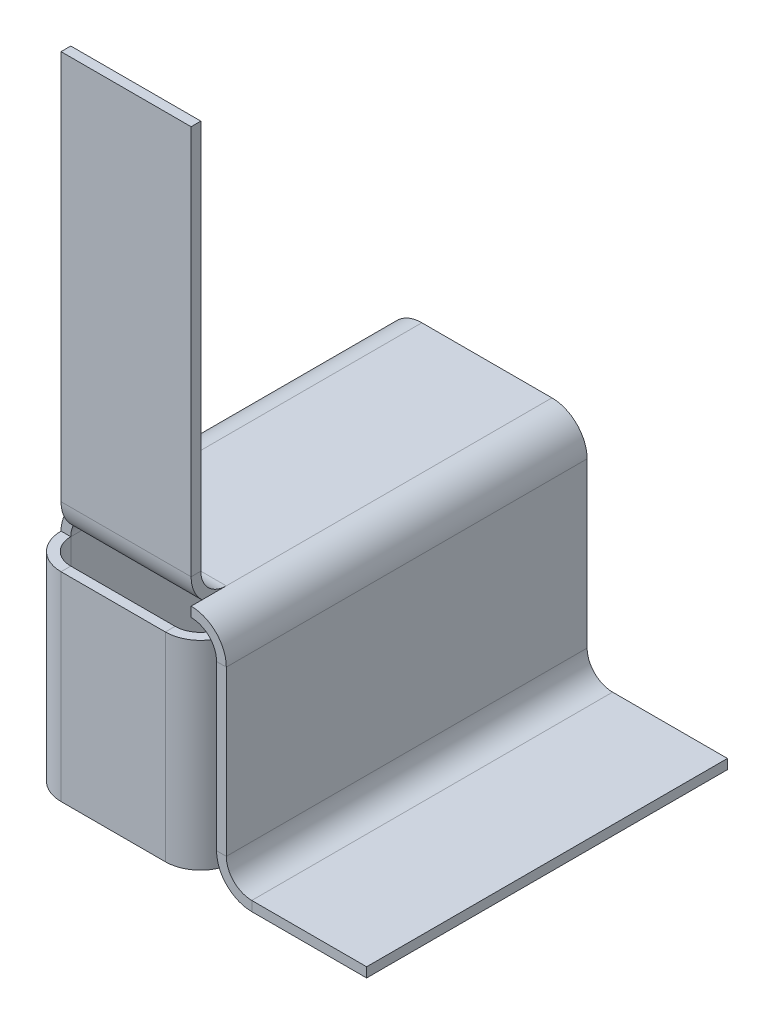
ISO-10303-21;
HEADER;
FILE_DESCRIPTION(('STEP AP214'),'2;1');
FILE_NAME('part.step','',(''),(''),'','','');
FILE_SCHEMA(('AUTOMOTIVE_DESIGN { 1 0 10303 214 1 1 1 1 }'));
ENDSEC;
DATA;
#1=APPLICATION_CONTEXT('core data for automotive mechanical design processes');
#2=APPLICATION_PROTOCOL_DEFINITION('international standard','automotive_design',2000,#1);
#3=PRODUCT_CONTEXT('',#1,'mechanical');
#4=PRODUCT('Part','Part','',(#3));
#5=PRODUCT_RELATED_PRODUCT_CATEGORY('part','',(#4));
#6=PRODUCT_DEFINITION_FORMATION('','',#4);
#7=PRODUCT_DEFINITION_CONTEXT('part definition',#1,'design');
#8=PRODUCT_DEFINITION('design','',#6,#7);
#9=PRODUCT_DEFINITION_SHAPE('','',#8);
#10=(LENGTH_UNIT() NAMED_UNIT(*) SI_UNIT(.MILLI.,.METRE.));
#11=(NAMED_UNIT(*) PLANE_ANGLE_UNIT() SI_UNIT($,.RADIAN.));
#12=(NAMED_UNIT(*) SI_UNIT($,.STERADIAN.) SOLID_ANGLE_UNIT());
#13=UNCERTAINTY_MEASURE_WITH_UNIT(LENGTH_MEASURE(1.E-05),#10,'distance_accuracy_value','');
#14=(GEOMETRIC_REPRESENTATION_CONTEXT(3) GLOBAL_UNCERTAINTY_ASSIGNED_CONTEXT((#13)) GLOBAL_UNIT_ASSIGNED_CONTEXT((#10,
#11,#12)) REPRESENTATION_CONTEXT('',''));
#15=CARTESIAN_POINT('',(0.,0.,0.));
#16=DIRECTION('',(0.,0.,1.));
#17=DIRECTION('',(1.,0.,0.));
#18=AXIS2_PLACEMENT_3D('',#15,#16,#17);
#19=CARTESIAN_POINT('',(-21.88912,28.,45.));
#20=DIRECTION('',(-1.,0.,0.));
#21=DIRECTION('',(0.,0.,1.));
#22=AXIS2_PLACEMENT_3D('',#19,#20,#21);
#23=PLANE('',#22);
#24=DIRECTION('',(0.,0.,-1.));
#25=VECTOR('',#24,1.);
#26=CARTESIAN_POINT('',(-21.88912,28.,45.));
#27=LINE('',#26,#25);
#28=CARTESIAN_POINT('',(-21.88912,28.,45.));
#29=VERTEX_POINT('',#28);
#30=CARTESIAN_POINT('',(-21.88912,28.,43.6413501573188));
#31=VERTEX_POINT('',#30);
#32=EDGE_CURVE('E552',#29,#31,#27,.T.);
#33=ORIENTED_EDGE('',*,*,#32,.T.);
#34=CARTESIAN_POINT('',(-21.88912,31.175,40.61088));
#35=DIRECTION('',(1.,0.,0.));
#36=DIRECTION('',(0.,0.,-1.));
#37=AXIS2_PLACEMENT_3D('',#34,#35,#36);
#38=CIRCLE('',#37,4.38912);
#39=CARTESIAN_POINT('',(-21.88912,26.78588,40.61088));
#40=VERTEX_POINT('',#39);
#41=EDGE_CURVE('E13',#31,#40,#38,.T.);
#42=ORIENTED_EDGE('',*,*,#41,.T.);
#43=DIRECTION('',(0.,0.,-1.));
#44=VECTOR('',#43,1.);
#45=CARTESIAN_POINT('',(-21.88912,26.78588,45.));
#46=LINE('',#45,#44);
#47=CARTESIAN_POINT('',(-21.88912,26.78588,45.));
#48=VERTEX_POINT('',#47);
#49=EDGE_CURVE('E536',#48,#40,#46,.T.);
#50=ORIENTED_EDGE('',*,*,#49,.F.);
#51=DIRECTION('',(0.,1.,0.));
#52=VECTOR('',#51,1.);
#53=CARTESIAN_POINT('',(-21.88912,26.78588,45.));
#54=LINE('',#53,#52);
#55=EDGE_CURVE('E580',#48,#29,#54,.T.);
#56=ORIENTED_EDGE('',*,*,#55,.T.);
#57=EDGE_LOOP('',(#33,#42,#50,#56));
#58=FACE_BOUND('',#57,.T.);
#59=ADVANCED_FACE('F98',(#58),#23,.T.);
#60=CARTESIAN_POINT('',(-42.5,28.,45.));
#61=DIRECTION('',(0.,1.,0.));
#62=DIRECTION('',(-1.,0.,0.));
#63=AXIS2_PLACEMENT_3D('',#60,#61,#62);
#64=PLANE('',#63);
#65=DIRECTION('',(0.,0.,-1.));
#66=VECTOR('',#65,1.);
#67=CARTESIAN_POINT('',(-38.11088,28.,45.));
#68=LINE('',#67,#66);
#69=CARTESIAN_POINT('',(-38.11088,28.,40.61088));
#70=VERTEX_POINT('',#69);
#71=CARTESIAN_POINT('',(-38.11088,28.,0.));
#72=VERTEX_POINT('',#71);
#73=EDGE_CURVE('E549',#70,#72,#68,.T.);
#74=ORIENTED_EDGE('',*,*,#73,.F.);
#75=DIRECTION('',(1.,0.,0.));
#76=VECTOR('',#75,1.);
#77=CARTESIAN_POINT('',(-21.88912,28.,40.61088));
#78=LINE('',#77,#76);
#79=CARTESIAN_POINT('',(-21.88912,28.,40.61088));
#80=VERTEX_POINT('',#79);
#81=EDGE_CURVE('E346',#80,#70,#78,.F.);
#82=ORIENTED_EDGE('',*,*,#81,.F.);
#83=CARTESIAN_POINT('',(-21.88912,28.,0.));
#84=VERTEX_POINT('',#83);
#85=EDGE_CURVE('E551',#80,#84,#27,.T.);
#86=ORIENTED_EDGE('',*,*,#85,.T.);
#87=DIRECTION('',(1.,0.,0.));
#88=VECTOR('',#87,1.);
#89=CARTESIAN_POINT('',(-42.5,28.,0.));
#90=LINE('',#89,#88);
#91=EDGE_CURVE('E498',#72,#84,#90,.T.);
#92=ORIENTED_EDGE('',*,*,#91,.F.);
#93=EDGE_LOOP('',(#74,#82,#86,#92));
#94=FACE_BOUND('',#93,.T.);
#95=ADVANCED_FACE('F603',(#94),#64,.T.);
#96=CARTESIAN_POINT('',(-42.5,26.78588,45.));
#97=DIRECTION('',(0.,1.,0.));
#98=DIRECTION('',(-1.,0.,0.));
#99=AXIS2_PLACEMENT_3D('',#96,#97,#98);
#100=PLANE('',#99);
#101=DIRECTION('',(1.,0.,0.));
#102=VECTOR('',#101,1.);
#103=CARTESIAN_POINT('',(-21.88912,26.78588,40.61088));
#104=LINE('',#103,#102);
#105=CARTESIAN_POINT('',(-38.11088,26.78588,40.61088));
#106=VERTEX_POINT('',#105);
#107=EDGE_CURVE('E335',#40,#106,#104,.F.);
#108=ORIENTED_EDGE('',*,*,#107,.T.);
#109=DIRECTION('',(0.,0.,-1.));
#110=VECTOR('',#109,1.);
#111=CARTESIAN_POINT('',(-38.11088,26.78588,45.));
#112=LINE('',#111,#110);
#113=CARTESIAN_POINT('',(-38.11088,26.78588,0.));
#114=VERTEX_POINT('',#113);
#115=EDGE_CURVE('E539',#106,#114,#112,.T.);
#116=ORIENTED_EDGE('',*,*,#115,.T.);
#117=DIRECTION('',(1.,0.,0.));
#118=VECTOR('',#117,1.);
#119=CARTESIAN_POINT('',(-42.5,26.78588,0.));
#120=LINE('',#119,#118);
#121=CARTESIAN_POINT('',(-21.88912,26.78588,0.));
#122=VERTEX_POINT('',#121);
#123=EDGE_CURVE('E516',#114,#122,#120,.T.);
#124=ORIENTED_EDGE('',*,*,#123,.T.);
#125=EDGE_CURVE('E535',#40,#122,#46,.T.);
#126=ORIENTED_EDGE('',*,*,#125,.F.);
#127=EDGE_LOOP('',(#108,#116,#124,#126));
#128=FACE_BOUND('',#127,.T.);
#129=ADVANCED_FACE('F717',(#128),#100,.F.);
#130=CARTESIAN_POINT('',(-20.71412,-1.21412,45.0000000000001));
#131=DIRECTION('',(0.,1.,0.));
#132=DIRECTION('',(-1.,0.,0.));
#133=AXIS2_PLACEMENT_3D('',#130,#131,#132);
#134=PLANE('',#133);
#135=DIRECTION('',(0.,0.,1.));
#136=VECTOR('',#135,1.);
#137=CARTESIAN_POINT('',(-25.10324,-1.21412,43.7858800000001));
#138=LINE('',#137,#136);
#139=CARTESIAN_POINT('',(-25.10324,-1.21412,43.7858800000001));
#140=VERTEX_POINT('',#139);
#141=CARTESIAN_POINT('',(-25.10324,-1.21412,45.0000000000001));
#142=VERTEX_POINT('',#141);
#143=EDGE_CURVE('E393',#140,#142,#138,.T.);
#144=ORIENTED_EDGE('',*,*,#143,.T.);
#145=DIRECTION('',(1.,0.,0.));
#146=VECTOR('',#145,1.);
#147=CARTESIAN_POINT('',(-1.55871364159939E-13,-1.21411999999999,45.0000000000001));
#148=LINE('',#147,#146);
#149=CARTESIAN_POINT('',(-38.11088,-1.21412,45.));
#150=VERTEX_POINT('',#149);
#151=EDGE_CURVE('E413',#150,#142,#148,.T.);
#152=ORIENTED_EDGE('',*,*,#151,.F.);
#153=DIRECTION('',(0.,0.,-1.));
#154=VECTOR('',#153,1.);
#155=CARTESIAN_POINT('',(-38.11088,-1.21412,43.78588));
#156=LINE('',#155,#154);
#157=CARTESIAN_POINT('',(-38.11088,-1.21412,43.78588));
#158=VERTEX_POINT('',#157);
#159=EDGE_CURVE('E423',#158,#150,#156,.F.);
#160=ORIENTED_EDGE('',*,*,#159,.F.);
#161=DIRECTION('',(-1.,0.,0.));
#162=VECTOR('',#161,1.);
#163=CARTESIAN_POINT('',(-20.71412,-1.21412,43.7858800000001));
#164=LINE('',#163,#162);
#165=EDGE_CURVE('E417',#158,#140,#164,.F.);
#166=ORIENTED_EDGE('',*,*,#165,.T.);
#167=EDGE_LOOP('',(#144,#152,#160,#166));
#168=FACE_BOUND('',#167,.T.);
#169=ADVANCED_FACE('F670',(#168),#134,.F.);
#170=CARTESIAN_POINT('',(-41.28588,23.61088,45.));
#171=DIRECTION('',(0.,-1.,0.));
#172=DIRECTION('',(0.,0.,-1.));
#173=AXIS2_PLACEMENT_3D('',#170,#171,#172);
#174=PLANE('',#173);
#175=DIRECTION('',(0.,0.,1.));
#176=VECTOR('',#175,1.);
#177=CARTESIAN_POINT('',(-25.10324,23.61088,43.7858800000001));
#178=LINE('',#177,#176);
#179=CARTESIAN_POINT('',(-25.10324,23.61088,43.7858800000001));
#180=VERTEX_POINT('',#179);
#181=CARTESIAN_POINT('',(-25.10324,23.61088,45.0000000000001));
#182=VERTEX_POINT('',#181);
#183=EDGE_CURVE('E404',#180,#182,#178,.T.);
#184=ORIENTED_EDGE('',*,*,#183,.F.);
#185=DIRECTION('',(1.,0.,0.));
#186=VECTOR('',#185,1.);
#187=CARTESIAN_POINT('',(-41.28588,23.61088,43.78588));
#188=LINE('',#187,#186);
#189=CARTESIAN_POINT('',(-38.11088,23.61088,43.78588));
#190=VERTEX_POINT('',#189);
#191=EDGE_CURVE('E415',#180,#190,#188,.F.);
#192=ORIENTED_EDGE('',*,*,#191,.T.);
#193=DIRECTION('',(0.,0.,-1.));
#194=VECTOR('',#193,1.);
#195=CARTESIAN_POINT('',(-38.11088,23.61088,45.));
#196=LINE('',#195,#194);
#197=CARTESIAN_POINT('',(-38.11088,23.61088,45.));
#198=VERTEX_POINT('',#197);
#199=EDGE_CURVE('E407',#190,#198,#196,.F.);
#200=ORIENTED_EDGE('',*,*,#199,.T.);
#201=DIRECTION('',(-1.,0.,0.));
#202=VECTOR('',#201,1.);
#203=CARTESIAN_POINT('',(-1.56024936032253E-13,23.61088,45.0000000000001));
#204=LINE('',#203,#202);
#205=EDGE_CURVE('E410',#182,#198,#204,.T.);
#206=ORIENTED_EDGE('',*,*,#205,.F.);
#207=EDGE_LOOP('',(#184,#192,#200,#206));
#208=FACE_BOUND('',#207,.T.);
#209=ADVANCED_FACE('F907',(#208),#174,.F.);
#210=CARTESIAN_POINT('',(-1.56024936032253E-13,0.,45.0000000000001));
#211=DIRECTION('',(0.,0.,-1.));
#212=DIRECTION('',(-1.,0.,0.));
#213=AXIS2_PLACEMENT_3D('',#210,#211,#212);
#214=PLANE('',#213);
#215=DIRECTION('',(0.,-1.,0.));
#216=VECTOR('',#215,1.);
#217=CARTESIAN_POINT('',(-25.10324,-1.21412,45.0000000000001));
#218=LINE('',#217,#216);
#219=EDGE_CURVE('E387',#142,#182,#218,.F.);
#220=ORIENTED_EDGE('',*,*,#219,.T.);
#221=ORIENTED_EDGE('',*,*,#205,.T.);
#222=DIRECTION('',(0.,-1.,0.));
#223=VECTOR('',#222,1.);
#224=CARTESIAN_POINT('',(-38.11088,23.61088,45.));
#225=LINE('',#224,#223);
#226=EDGE_CURVE('E420',#150,#198,#225,.F.);
#227=ORIENTED_EDGE('',*,*,#226,.F.);
#228=ORIENTED_EDGE('',*,*,#151,.T.);
#229=EDGE_LOOP('',(#220,#221,#227,#228));
#230=FACE_BOUND('',#229,.T.);
#231=ADVANCED_FACE('F668',(#230),#214,.F.);
#232=CARTESIAN_POINT('',(-1.51785858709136E-13,0.,43.7858800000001));
#233=DIRECTION('',(0.,0.,-1.));
#234=DIRECTION('',(-1.,0.,0.));
#235=AXIS2_PLACEMENT_3D('',#232,#233,#234);
#236=PLANE('',#235);
#237=ORIENTED_EDGE('',*,*,#191,.F.);
#238=DIRECTION('',(0.,-1.,0.));
#239=VECTOR('',#238,1.);
#240=CARTESIAN_POINT('',(-25.10324,-1.21412,43.7858800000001));
#241=LINE('',#240,#239);
#242=EDGE_CURVE('E399',#140,#180,#241,.F.);
#243=ORIENTED_EDGE('',*,*,#242,.F.);
#244=ORIENTED_EDGE('',*,*,#165,.F.);
#245=DIRECTION('',(0.,-1.,0.));
#246=VECTOR('',#245,1.);
#247=CARTESIAN_POINT('',(-38.11088,23.61088,43.78588));
#248=LINE('',#247,#246);
#249=EDGE_CURVE('E426',#190,#158,#248,.T.);
#250=ORIENTED_EDGE('',*,*,#249,.F.);
#251=EDGE_LOOP('',(#237,#243,#244,#250));
#252=FACE_BOUND('',#251,.T.);
#253=ADVANCED_FACE('F925',(#252),#236,.T.);
#254=CARTESIAN_POINT('',(-38.11088,23.61088,45.));
#255=DIRECTION('',(0.,0.,-1.));
#256=DIRECTION('',(-1.,0.,0.));
#257=AXIS2_PLACEMENT_3D('',#254,#255,#256);
#258=CYLINDRICAL_SURFACE('',#257,4.38912);
#259=DIRECTION('',(0.,0.,-1.));
#260=VECTOR('',#259,1.);
#261=CARTESIAN_POINT('',(-42.5,23.61088,45.));
#262=LINE('',#261,#260);
#263=CARTESIAN_POINT('',(-42.5,23.61088,40.61088));
#264=VERTEX_POINT('',#263);
#265=CARTESIAN_POINT('',(-42.5,23.61088,0.));
#266=VERTEX_POINT('',#265);
#267=EDGE_CURVE('E547',#264,#266,#262,.T.);
#268=ORIENTED_EDGE('',*,*,#267,.F.);
#269=CARTESIAN_POINT('',(-38.11088,23.61088,40.61088));
#270=DIRECTION('',(0.,0.,1.));
#271=DIRECTION('',(1.,0.,0.));
#272=AXIS2_PLACEMENT_3D('',#269,#270,#271);
#273=CIRCLE('',#272,4.38912);
#274=EDGE_CURVE('E102',#264,#70,#273,.F.);
#275=ORIENTED_EDGE('',*,*,#274,.T.);
#276=ORIENTED_EDGE('',*,*,#73,.T.);
#277=CARTESIAN_POINT('',(-38.11088,23.61088,0.));
#278=DIRECTION('',(0.,0.,1.));
#279=DIRECTION('',(1.,0.,0.));
#280=AXIS2_PLACEMENT_3D('',#277,#278,#279);
#281=CIRCLE('',#280,4.38912);
#282=EDGE_CURVE('E501',#266,#72,#281,.F.);
#283=ORIENTED_EDGE('',*,*,#282,.F.);
#284=EDGE_LOOP('',(#268,#275,#276,#283));
#285=FACE_BOUND('',#284,.T.);
#286=ADVANCED_FACE('F599',(#285),#258,.T.);
#287=CARTESIAN_POINT('',(-38.11088,23.61088,40.61088));
#288=DIRECTION('',(0.,0.,1.));
#289=DIRECTION('',(1.,0.,0.));
#290=AXIS2_PLACEMENT_3D('',#287,#288,#289);
#291=PLANE('',#290);
#292=DIRECTION('',(0.,-1.,0.));
#293=VECTOR('',#292,1.);
#294=CARTESIAN_POINT('',(-38.11088,28.,40.61088));
#295=LINE('',#294,#293);
#296=EDGE_CURVE('E340',#70,#106,#295,.T.);
#297=ORIENTED_EDGE('',*,*,#296,.F.);
#298=ORIENTED_EDGE('',*,*,#274,.F.);
#299=DIRECTION('',(-1.,0.,0.));
#300=VECTOR('',#299,1.);
#301=CARTESIAN_POINT('',(-41.28588,23.61088,40.61088));
#302=LINE('',#301,#300);
#303=CARTESIAN_POINT('',(-41.28588,23.61088,40.61088));
#304=VERTEX_POINT('',#303);
#305=EDGE_CURVE('E447',#304,#264,#302,.T.);
#306=ORIENTED_EDGE('',*,*,#305,.F.);
#307=CARTESIAN_POINT('',(-38.11088,23.61088,40.61088));
#308=DIRECTION('',(0.,0.,1.));
#309=DIRECTION('',(1.,0.,0.));
#310=AXIS2_PLACEMENT_3D('',#307,#308,#309);
#311=CIRCLE('',#310,3.175);
#312=EDGE_CURVE('E589',#304,#106,#311,.F.);
#313=ORIENTED_EDGE('',*,*,#312,.T.);
#314=EDGE_LOOP('',(#297,#298,#306,#313));
#315=FACE_BOUND('',#314,.T.);
#316=ADVANCED_FACE('F100',(#315),#291,.T.);
#317=CARTESIAN_POINT('',(-42.5,28.,45.));
#318=DIRECTION('',(-1.,0.,0.));
#319=DIRECTION('',(0.,-1.,0.));
#320=AXIS2_PLACEMENT_3D('',#317,#318,#319);
#321=PLANE('',#320);
#322=DIRECTION('',(0.,0.,-1.));
#323=VECTOR('',#322,1.);
#324=CARTESIAN_POINT('',(-42.5,-1.21412,45.));
#325=LINE('',#324,#323);
#326=CARTESIAN_POINT('',(-42.5,-1.21412,40.61088));
#327=VERTEX_POINT('',#326);
#328=CARTESIAN_POINT('',(-42.5,-1.21412,0.));
#329=VERTEX_POINT('',#328);
#330=EDGE_CURVE('E545',#327,#329,#325,.T.);
#331=ORIENTED_EDGE('',*,*,#330,.F.);
#332=DIRECTION('',(0.,-1.,0.));
#333=VECTOR('',#332,1.);
#334=CARTESIAN_POINT('',(-42.5,-1.21412,40.61088));
#335=LINE('',#334,#333);
#336=EDGE_CURVE('E430',#327,#264,#335,.F.);
#337=ORIENTED_EDGE('',*,*,#336,.T.);
#338=ORIENTED_EDGE('',*,*,#267,.T.);
#339=DIRECTION('',(0.,1.,0.));
#340=VECTOR('',#339,1.);
#341=CARTESIAN_POINT('',(-42.5,28.,0.));
#342=LINE('',#341,#340);
#343=EDGE_CURVE('E504',#329,#266,#342,.T.);
#344=ORIENTED_EDGE('',*,*,#343,.F.);
#345=EDGE_LOOP('',(#331,#337,#338,#344));
#346=FACE_BOUND('',#345,.T.);
#347=ADVANCED_FACE('F656',(#346),#321,.T.);
#348=CARTESIAN_POINT('',(-41.28588,-1.21412,45.));
#349=DIRECTION('',(0.,-1.,0.));
#350=DIRECTION('',(1.,0.,0.));
#351=AXIS2_PLACEMENT_3D('',#348,#349,#350);
#352=PLANE('',#351);
#353=DIRECTION('',(0.,0.,-1.));
#354=VECTOR('',#353,1.);
#355=CARTESIAN_POINT('',(-41.28588,-1.21412,45.));
#356=LINE('',#355,#354);
#357=CARTESIAN_POINT('',(-41.28588,-1.21412,40.61088));
#358=VERTEX_POINT('',#357);
#359=CARTESIAN_POINT('',(-41.28588,-1.21412,0.));
#360=VERTEX_POINT('',#359);
#361=EDGE_CURVE('E543',#358,#360,#356,.T.);
#362=ORIENTED_EDGE('',*,*,#361,.F.);
#363=DIRECTION('',(-1.,0.,0.));
#364=VECTOR('',#363,1.);
#365=CARTESIAN_POINT('',(-41.28588,-1.21412,40.61088));
#366=LINE('',#365,#364);
#367=EDGE_CURVE('E437',#358,#327,#366,.T.);
#368=ORIENTED_EDGE('',*,*,#367,.T.);
#369=ORIENTED_EDGE('',*,*,#330,.T.);
#370=DIRECTION('',(-1.,0.,0.));
#371=VECTOR('',#370,1.);
#372=CARTESIAN_POINT('',(-41.28588,-1.21412,0.));
#373=LINE('',#372,#371);
#374=EDGE_CURVE('E507',#360,#329,#373,.T.);
#375=ORIENTED_EDGE('',*,*,#374,.F.);
#376=EDGE_LOOP('',(#362,#368,#369,#375));
#377=FACE_BOUND('',#376,.T.);
#378=ADVANCED_FACE('F653',(#377),#352,.T.);
#379=CARTESIAN_POINT('',(-41.28588,28.,45.));
#380=DIRECTION('',(-1.,0.,0.));
#381=DIRECTION('',(0.,-1.,0.));
#382=AXIS2_PLACEMENT_3D('',#379,#380,#381);
#383=PLANE('',#382);
#384=DIRECTION('',(0.,-1.,0.));
#385=VECTOR('',#384,1.);
#386=CARTESIAN_POINT('',(-41.28588,-1.21412,40.61088));
#387=LINE('',#386,#385);
#388=EDGE_CURVE('E443',#358,#304,#387,.F.);
#389=ORIENTED_EDGE('',*,*,#388,.F.);
#390=ORIENTED_EDGE('',*,*,#361,.T.);
#391=DIRECTION('',(0.,1.,0.));
#392=VECTOR('',#391,1.);
#393=CARTESIAN_POINT('',(-41.28588,28.,0.));
#394=LINE('',#393,#392);
#395=CARTESIAN_POINT('',(-41.28588,23.61088,0.));
#396=VERTEX_POINT('',#395);
#397=EDGE_CURVE('E510',#360,#396,#394,.T.);
#398=ORIENTED_EDGE('',*,*,#397,.T.);
#399=DIRECTION('',(0.,0.,-1.));
#400=VECTOR('',#399,1.);
#401=CARTESIAN_POINT('',(-41.28588,23.61088,45.));
#402=LINE('',#401,#400);
#403=EDGE_CURVE('E541',#304,#396,#402,.T.);
#404=ORIENTED_EDGE('',*,*,#403,.F.);
#405=EDGE_LOOP('',(#389,#390,#398,#404));
#406=FACE_BOUND('',#405,.T.);
#407=ADVANCED_FACE('F650',(#406),#383,.F.);
#408=CARTESIAN_POINT('',(-42.5,23.61088,0.));
#409=DIRECTION('',(0.,0.,-1.));
#410=DIRECTION('',(-1.,0.,0.));
#411=AXIS2_PLACEMENT_3D('',#408,#409,#410);
#412=PLANE('',#411);
#413=DIRECTION('',(1.,0.,0.));
#414=VECTOR('',#413,1.);
#415=CARTESIAN_POINT('',(-42.5,23.61088,0.));
#416=LINE('',#415,#414);
#417=EDGE_CURVE('E587',#266,#396,#416,.T.);
#418=ORIENTED_EDGE('',*,*,#417,.F.);
#419=ORIENTED_EDGE('',*,*,#282,.T.);
#420=DIRECTION('',(0.,1.,0.));
#421=VECTOR('',#420,1.);
#422=CARTESIAN_POINT('',(-38.11088,26.78588,0.));
#423=LINE('',#422,#421);
#424=EDGE_CURVE('E584',#114,#72,#423,.T.);
#425=ORIENTED_EDGE('',*,*,#424,.F.);
#426=CARTESIAN_POINT('',(-38.11088,23.61088,0.));
#427=DIRECTION('',(0.,0.,1.));
#428=DIRECTION('',(1.,0.,0.));
#429=AXIS2_PLACEMENT_3D('',#426,#427,#428);
#430=CIRCLE('',#429,3.175);
#431=EDGE_CURVE('E513',#396,#114,#430,.F.);
#432=ORIENTED_EDGE('',*,*,#431,.F.);
#433=EDGE_LOOP('',(#418,#419,#425,#432));
#434=FACE_BOUND('',#433,.T.);
#435=ADVANCED_FACE('F639',(#434),#412,.T.);
#436=CARTESIAN_POINT('',(-38.11088,26.78588,0.));
#437=DIRECTION('',(0.,0.,-1.));
#438=DIRECTION('',(-1.,0.,0.));
#439=AXIS2_PLACEMENT_3D('',#436,#437,#438);
#440=PLANE('',#439);
#441=ORIENTED_EDGE('',*,*,#343,.T.);
#442=ORIENTED_EDGE('',*,*,#417,.T.);
#443=ORIENTED_EDGE('',*,*,#397,.F.);
#444=ORIENTED_EDGE('',*,*,#374,.T.);
#445=EDGE_LOOP('',(#441,#442,#443,#444));
#446=FACE_BOUND('',#445,.T.);
#447=ADVANCED_FACE('F647',(#446),#440,.T.);
#448=CARTESIAN_POINT('',(-17.5,23.61088,45.));
#449=DIRECTION('',(0.,0.,1.));
#450=DIRECTION('',(1.,0.,0.));
#451=AXIS2_PLACEMENT_3D('',#448,#449,#450);
#452=PLANE('',#451);
#453=DIRECTION('',(-1.,0.,0.));
#454=VECTOR('',#453,1.);
#455=CARTESIAN_POINT('',(-17.5,23.61088,45.));
#456=LINE('',#455,#454);
#457=CARTESIAN_POINT('',(-17.5,23.61088,45.));
#458=VERTEX_POINT('',#457);
#459=CARTESIAN_POINT('',(-18.71412,23.61088,45.));
#460=VERTEX_POINT('',#459);
#461=EDGE_CURVE('E582',#458,#460,#456,.T.);
#462=ORIENTED_EDGE('',*,*,#461,.F.);
#463=CARTESIAN_POINT('',(-21.88912,23.61088,45.));
#464=DIRECTION('',(0.,0.,1.));
#465=DIRECTION('',(1.,0.,0.));
#466=AXIS2_PLACEMENT_3D('',#463,#464,#465);
#467=CIRCLE('',#466,4.38912);
#468=EDGE_CURVE('E468',#29,#458,#467,.F.);
#469=ORIENTED_EDGE('',*,*,#468,.F.);
#470=ORIENTED_EDGE('',*,*,#55,.F.);
#471=CARTESIAN_POINT('',(-21.88912,23.61088,45.));
#472=DIRECTION('',(0.,0.,1.));
#473=DIRECTION('',(1.,0.,0.));
#474=AXIS2_PLACEMENT_3D('',#471,#472,#473);
#475=CIRCLE('',#474,3.175);
#476=EDGE_CURVE('E471',#48,#460,#475,.F.);
#477=ORIENTED_EDGE('',*,*,#476,.T.);
#478=EDGE_LOOP('',(#462,#469,#470,#477));
#479=FACE_BOUND('',#478,.T.);
#480=ADVANCED_FACE('F1203',(#479),#452,.T.);
#481=CARTESIAN_POINT('',(-21.88912,26.78588,45.));
#482=DIRECTION('',(0.,0.,1.));
#483=DIRECTION('',(1.,0.,0.));
#484=AXIS2_PLACEMENT_3D('',#481,#482,#483);
#485=PLANE('',#484);
#486=DIRECTION('',(0.,-1.,0.));
#487=VECTOR('',#486,1.);
#488=CARTESIAN_POINT('',(-17.5,28.,45.));
#489=LINE('',#488,#487);
#490=CARTESIAN_POINT('',(-17.5,3.175,45.));
#491=VERTEX_POINT('',#490);
#492=EDGE_CURVE('E465',#458,#491,#489,.T.);
#493=ORIENTED_EDGE('',*,*,#492,.F.);
#494=ORIENTED_EDGE('',*,*,#461,.T.);
#495=DIRECTION('',(0.,1.,0.));
#496=VECTOR('',#495,1.);
#497=CARTESIAN_POINT('',(-18.71412,28.,45.));
#498=LINE('',#497,#496);
#499=CARTESIAN_POINT('',(-18.71412,3.175,45.));
#500=VERTEX_POINT('',#499);
#501=EDGE_CURVE('E474',#460,#500,#498,.F.);
#502=ORIENTED_EDGE('',*,*,#501,.T.);
#503=DIRECTION('',(1.,0.,0.));
#504=VECTOR('',#503,1.);
#505=CARTESIAN_POINT('',(-18.71412,3.175,45.));
#506=LINE('',#505,#504);
#507=EDGE_CURVE('E571',#500,#491,#506,.T.);
#508=ORIENTED_EDGE('',*,*,#507,.T.);
#509=EDGE_LOOP('',(#493,#494,#502,#508));
#510=FACE_BOUND('',#509,.T.);
#511=ADVANCED_FACE('F1194',(#510),#485,.T.);
#512=CARTESIAN_POINT('',(-21.88912,28.,0.));
#513=DIRECTION('',(0.,0.,-1.));
#514=DIRECTION('',(-1.,0.,0.));
#515=AXIS2_PLACEMENT_3D('',#512,#513,#514);
#516=PLANE('',#515);
#517=DIRECTION('',(0.,-1.,0.));
#518=VECTOR('',#517,1.);
#519=CARTESIAN_POINT('',(-21.88912,28.,0.));
#520=LINE('',#519,#518);
#521=EDGE_CURVE('E577',#84,#122,#520,.T.);
#522=ORIENTED_EDGE('',*,*,#521,.F.);
#523=CARTESIAN_POINT('',(-21.88912,23.61088,0.));
#524=DIRECTION('',(0.,0.,1.));
#525=DIRECTION('',(1.,0.,0.));
#526=AXIS2_PLACEMENT_3D('',#523,#524,#525);
#527=CIRCLE('',#526,4.38912);
#528=CARTESIAN_POINT('',(-17.5,23.61088,0.));
#529=VERTEX_POINT('',#528);
#530=EDGE_CURVE('E495',#84,#529,#527,.F.);
#531=ORIENTED_EDGE('',*,*,#530,.T.);
#532=DIRECTION('',(1.,0.,0.));
#533=VECTOR('',#532,1.);
#534=CARTESIAN_POINT('',(-18.71412,23.61088,0.));
#535=LINE('',#534,#533);
#536=CARTESIAN_POINT('',(-18.71412,23.61088,0.));
#537=VERTEX_POINT('',#536);
#538=EDGE_CURVE('E575',#537,#529,#535,.T.);
#539=ORIENTED_EDGE('',*,*,#538,.F.);
#540=CARTESIAN_POINT('',(-21.88912,23.61088,0.));
#541=DIRECTION('',(0.,0.,1.));
#542=DIRECTION('',(1.,0.,0.));
#543=AXIS2_PLACEMENT_3D('',#540,#541,#542);
#544=CIRCLE('',#543,3.175);
#545=EDGE_CURVE('E519',#122,#537,#544,.F.);
#546=ORIENTED_EDGE('',*,*,#545,.F.);
#547=EDGE_LOOP('',(#522,#531,#539,#546));
#548=FACE_BOUND('',#547,.T.);
#549=ADVANCED_FACE('F628',(#548),#516,.T.);
#550=CARTESIAN_POINT('',(-18.71412,23.61088,0.));
#551=DIRECTION('',(0.,0.,-1.));
#552=DIRECTION('',(-1.,0.,0.));
#553=AXIS2_PLACEMENT_3D('',#550,#551,#552);
#554=PLANE('',#553);
#555=ORIENTED_EDGE('',*,*,#91,.T.);
#556=ORIENTED_EDGE('',*,*,#521,.T.);
#557=ORIENTED_EDGE('',*,*,#123,.F.);
#558=ORIENTED_EDGE('',*,*,#424,.T.);
#559=EDGE_LOOP('',(#555,#556,#557,#558));
#560=FACE_BOUND('',#559,.T.);
#561=ADVANCED_FACE('F634',(#560),#554,.T.);
#562=CARTESIAN_POINT('',(-14.325,0.,45.));
#563=DIRECTION('',(0.,0.,1.));
#564=DIRECTION('',(1.,0.,0.));
#565=AXIS2_PLACEMENT_3D('',#562,#563,#564);
#566=PLANE('',#565);
#567=DIRECTION('',(0.,-1.,0.));
#568=VECTOR('',#567,1.);
#569=CARTESIAN_POINT('',(-14.325,0.,45.));
#570=LINE('',#569,#568);
#571=CARTESIAN_POINT('',(-14.325,0.,45.));
#572=VERTEX_POINT('',#571);
#573=CARTESIAN_POINT('',(-14.325,-1.21412,45.));
#574=VERTEX_POINT('',#573);
#575=EDGE_CURVE('E573',#572,#574,#570,.T.);
#576=ORIENTED_EDGE('',*,*,#575,.F.);
#577=CARTESIAN_POINT('',(-14.325,3.175,45.));
#578=DIRECTION('',(0.,0.,-1.));
#579=DIRECTION('',(-1.,0.,0.));
#580=AXIS2_PLACEMENT_3D('',#577,#578,#579);
#581=CIRCLE('',#580,3.175);
#582=EDGE_CURVE('E462',#491,#572,#581,.F.);
#583=ORIENTED_EDGE('',*,*,#582,.F.);
#584=ORIENTED_EDGE('',*,*,#507,.F.);
#585=CARTESIAN_POINT('',(-14.325,3.175,45.));
#586=DIRECTION('',(0.,0.,1.));
#587=DIRECTION('',(1.,0.,0.));
#588=AXIS2_PLACEMENT_3D('',#585,#586,#587);
#589=CIRCLE('',#588,4.38912);
#590=EDGE_CURVE('E477',#500,#574,#589,.T.);
#591=ORIENTED_EDGE('',*,*,#590,.T.);
#592=EDGE_LOOP('',(#576,#583,#584,#591));
#593=FACE_BOUND('',#592,.T.);
#594=ADVANCED_FACE('F1165',(#593),#566,.T.);
#595=CARTESIAN_POINT('',(-18.71412,3.175,45.));
#596=DIRECTION('',(0.,0.,1.));
#597=DIRECTION('',(1.,0.,0.));
#598=AXIS2_PLACEMENT_3D('',#595,#596,#597);
#599=PLANE('',#598);
#600=DIRECTION('',(1.,0.,0.));
#601=VECTOR('',#600,1.);
#602=CARTESIAN_POINT('',(-17.5,0.,45.));
#603=LINE('',#602,#601);
#604=CARTESIAN_POINT('',(0.,0.,45.));
#605=VERTEX_POINT('',#604);
#606=EDGE_CURVE('E459',#572,#605,#603,.T.);
#607=ORIENTED_EDGE('',*,*,#606,.F.);
#608=ORIENTED_EDGE('',*,*,#575,.T.);
#609=DIRECTION('',(1.,0.,0.));
#610=VECTOR('',#609,1.);
#611=CARTESIAN_POINT('',(-17.5,-1.21412,45.));
#612=LINE('',#611,#610);
#613=CARTESIAN_POINT('',(0.,-1.21412,45.));
#614=VERTEX_POINT('',#613);
#615=EDGE_CURVE('E453',#574,#614,#612,.T.);
#616=ORIENTED_EDGE('',*,*,#615,.T.);
#617=DIRECTION('',(0.,-1.,0.));
#618=VECTOR('',#617,1.);
#619=CARTESIAN_POINT('',(0.,0.,45.));
#620=LINE('',#619,#618);
#621=EDGE_CURVE('E455',#605,#614,#620,.T.);
#622=ORIENTED_EDGE('',*,*,#621,.F.);
#623=EDGE_LOOP('',(#607,#608,#616,#622));
#624=FACE_BOUND('',#623,.T.);
#625=ADVANCED_FACE('F1155',(#624),#599,.T.);
#626=CARTESIAN_POINT('',(-17.5,3.175,0.));
#627=DIRECTION('',(0.,0.,-1.));
#628=DIRECTION('',(-1.,0.,0.));
#629=AXIS2_PLACEMENT_3D('',#626,#627,#628);
#630=PLANE('',#629);
#631=DIRECTION('',(-1.,0.,0.));
#632=VECTOR('',#631,1.);
#633=CARTESIAN_POINT('',(-17.5,3.175,0.));
#634=LINE('',#633,#632);
#635=CARTESIAN_POINT('',(-17.5,3.175,0.));
#636=VERTEX_POINT('',#635);
#637=CARTESIAN_POINT('',(-18.71412,3.175,0.));
#638=VERTEX_POINT('',#637);
#639=EDGE_CURVE('E569',#636,#638,#634,.T.);
#640=ORIENTED_EDGE('',*,*,#639,.F.);
#641=CARTESIAN_POINT('',(-14.325,3.175,0.));
#642=DIRECTION('',(0.,0.,-1.));
#643=DIRECTION('',(-1.,0.,0.));
#644=AXIS2_PLACEMENT_3D('',#641,#642,#643);
#645=CIRCLE('',#644,3.175);
#646=CARTESIAN_POINT('',(-14.325,0.,0.));
#647=VERTEX_POINT('',#646);
#648=EDGE_CURVE('E489',#636,#647,#645,.F.);
#649=ORIENTED_EDGE('',*,*,#648,.T.);
#650=DIRECTION('',(0.,1.,0.));
#651=VECTOR('',#650,1.);
#652=CARTESIAN_POINT('',(-14.325,-1.21412,0.));
#653=LINE('',#652,#651);
#654=CARTESIAN_POINT('',(-14.325,-1.21412,0.));
#655=VERTEX_POINT('',#654);
#656=EDGE_CURVE('E567',#655,#647,#653,.T.);
#657=ORIENTED_EDGE('',*,*,#656,.F.);
#658=CARTESIAN_POINT('',(-14.325,3.175,0.));
#659=DIRECTION('',(0.,0.,1.));
#660=DIRECTION('',(1.,0.,0.));
#661=AXIS2_PLACEMENT_3D('',#658,#659,#660);
#662=CIRCLE('',#661,4.38912);
#663=EDGE_CURVE('E456',#638,#655,#662,.T.);
#664=ORIENTED_EDGE('',*,*,#663,.F.);
#665=EDGE_LOOP('',(#640,#649,#657,#664));
#666=FACE_BOUND('',#665,.T.);
#667=ADVANCED_FACE('F1144',(#666),#630,.T.);
#668=CARTESIAN_POINT('',(-14.325,-1.21412,0.));
#669=DIRECTION('',(0.,0.,-1.));
#670=DIRECTION('',(-1.,0.,0.));
#671=AXIS2_PLACEMENT_3D('',#668,#669,#670);
#672=PLANE('',#671);
#673=DIRECTION('',(0.,-1.,0.));
#674=VECTOR('',#673,1.);
#675=CARTESIAN_POINT('',(-17.5,28.,0.));
#676=LINE('',#675,#674);
#677=EDGE_CURVE('E492',#529,#636,#676,.T.);
#678=ORIENTED_EDGE('',*,*,#677,.T.);
#679=ORIENTED_EDGE('',*,*,#639,.T.);
#680=DIRECTION('',(0.,1.,0.));
#681=VECTOR('',#680,1.);
#682=CARTESIAN_POINT('',(-18.71412,28.,0.));
#683=LINE('',#682,#681);
#684=EDGE_CURVE('E522',#537,#638,#683,.F.);
#685=ORIENTED_EDGE('',*,*,#684,.F.);
#686=ORIENTED_EDGE('',*,*,#538,.T.);
#687=EDGE_LOOP('',(#678,#679,#685,#686));
#688=FACE_BOUND('',#687,.T.);
#689=ADVANCED_FACE('F1133',(#688),#672,.T.);
#690=CARTESIAN_POINT('',(-17.5,-1.21412,45.));
#691=DIRECTION('',(0.,1.,0.));
#692=DIRECTION('',(0.,0.,1.));
#693=AXIS2_PLACEMENT_3D('',#690,#691,#692);
#694=PLANE('',#693);
#695=DIRECTION('',(1.,0.,0.));
#696=VECTOR('',#695,1.);
#697=CARTESIAN_POINT('',(-17.5,-1.21412,0.));
#698=LINE('',#697,#696);
#699=CARTESIAN_POINT('',(0.,-1.21412,0.));
#700=VERTEX_POINT('',#699);
#701=EDGE_CURVE('E450',#655,#700,#698,.T.);
#702=ORIENTED_EDGE('',*,*,#701,.T.);
#703=DIRECTION('',(0.,0.,-1.));
#704=VECTOR('',#703,1.);
#705=CARTESIAN_POINT('',(0.,-1.21412,45.));
#706=LINE('',#705,#704);
#707=EDGE_CURVE('E565',#614,#700,#706,.T.);
#708=ORIENTED_EDGE('',*,*,#707,.F.);
#709=ORIENTED_EDGE('',*,*,#615,.F.);
#710=DIRECTION('',(0.,0.,-1.));
#711=VECTOR('',#710,1.);
#712=CARTESIAN_POINT('',(-14.325,-1.21412,45.));
#713=LINE('',#712,#711);
#714=EDGE_CURVE('E480',#574,#655,#713,.T.);
#715=ORIENTED_EDGE('',*,*,#714,.T.);
#716=EDGE_LOOP('',(#702,#708,#709,#715));
#717=FACE_BOUND('',#716,.T.);
#718=ADVANCED_FACE('F1122',(#717),#694,.F.);
#719=CARTESIAN_POINT('',(0.,0.,45.));
#720=DIRECTION('',(1.,0.,0.));
#721=DIRECTION('',(0.,1.,0.));
#722=AXIS2_PLACEMENT_3D('',#719,#720,#721);
#723=PLANE('',#722);
#724=DIRECTION('',(0.,-1.,0.));
#725=VECTOR('',#724,1.);
#726=CARTESIAN_POINT('',(0.,0.,0.));
#727=LINE('',#726,#725);
#728=CARTESIAN_POINT('',(0.,0.,0.));
#729=VERTEX_POINT('',#728);
#730=EDGE_CURVE('E483',#729,#700,#727,.T.);
#731=ORIENTED_EDGE('',*,*,#730,.F.);
#732=DIRECTION('',(0.,0.,-1.));
#733=VECTOR('',#732,1.);
#734=CARTESIAN_POINT('',(0.,0.,45.));
#735=LINE('',#734,#733);
#736=EDGE_CURVE('E563',#605,#729,#735,.T.);
#737=ORIENTED_EDGE('',*,*,#736,.F.);
#738=ORIENTED_EDGE('',*,*,#621,.T.);
#739=ORIENTED_EDGE('',*,*,#707,.T.);
#740=EDGE_LOOP('',(#731,#737,#738,#739));
#741=FACE_BOUND('',#740,.T.);
#742=ADVANCED_FACE('F1111',(#741),#723,.T.);
#743=CARTESIAN_POINT('',(-17.5,0.,45.));
#744=DIRECTION('',(0.,1.,0.));
#745=DIRECTION('',(0.,0.,1.));
#746=AXIS2_PLACEMENT_3D('',#743,#744,#745);
#747=PLANE('',#746);
#748=DIRECTION('',(1.,0.,0.));
#749=VECTOR('',#748,1.);
#750=CARTESIAN_POINT('',(-17.5,0.,0.));
#751=LINE('',#750,#749);
#752=EDGE_CURVE('E486',#647,#729,#751,.T.);
#753=ORIENTED_EDGE('',*,*,#752,.F.);
#754=DIRECTION('',(0.,0.,-1.));
#755=VECTOR('',#754,1.);
#756=CARTESIAN_POINT('',(-14.325,0.,45.));
#757=LINE('',#756,#755);
#758=EDGE_CURVE('E560',#572,#647,#757,.T.);
#759=ORIENTED_EDGE('',*,*,#758,.F.);
#760=ORIENTED_EDGE('',*,*,#606,.T.);
#761=ORIENTED_EDGE('',*,*,#736,.T.);
#762=EDGE_LOOP('',(#753,#759,#760,#761));
#763=FACE_BOUND('',#762,.T.);
#764=ADVANCED_FACE('F1101',(#763),#747,.T.);
#765=CARTESIAN_POINT('',(-14.325,3.175,45.));
#766=DIRECTION('',(0.,0.,-1.));
#767=DIRECTION('',(-1.,0.,0.));
#768=AXIS2_PLACEMENT_3D('',#765,#766,#767);
#769=CYLINDRICAL_SURFACE('',#768,3.175);
#770=ORIENTED_EDGE('',*,*,#648,.F.);
#771=DIRECTION('',(0.,0.,-1.));
#772=VECTOR('',#771,1.);
#773=CARTESIAN_POINT('',(-17.5,3.175,45.));
#774=LINE('',#773,#772);
#775=EDGE_CURVE('E557',#491,#636,#774,.T.);
#776=ORIENTED_EDGE('',*,*,#775,.F.);
#777=ORIENTED_EDGE('',*,*,#582,.T.);
#778=ORIENTED_EDGE('',*,*,#758,.T.);
#779=EDGE_LOOP('',(#770,#776,#777,#778));
#780=FACE_BOUND('',#779,.T.);
#781=ADVANCED_FACE('F1090',(#780),#769,.F.);
#782=CARTESIAN_POINT('',(-17.5,28.,45.));
#783=DIRECTION('',(1.,0.,0.));
#784=DIRECTION('',(0.,0.,-1.));
#785=AXIS2_PLACEMENT_3D('',#782,#783,#784);
#786=PLANE('',#785);
#787=ORIENTED_EDGE('',*,*,#677,.F.);
#788=DIRECTION('',(0.,0.,-1.));
#789=VECTOR('',#788,1.);
#790=CARTESIAN_POINT('',(-17.5,23.61088,45.));
#791=LINE('',#790,#789);
#792=EDGE_CURVE('E554',#458,#529,#791,.T.);
#793=ORIENTED_EDGE('',*,*,#792,.F.);
#794=ORIENTED_EDGE('',*,*,#492,.T.);
#795=ORIENTED_EDGE('',*,*,#775,.T.);
#796=EDGE_LOOP('',(#787,#793,#794,#795));
#797=FACE_BOUND('',#796,.T.);
#798=ADVANCED_FACE('F1080',(#797),#786,.T.);
#799=CARTESIAN_POINT('',(-21.88912,23.61088,45.));
#800=DIRECTION('',(0.,0.,-1.));
#801=DIRECTION('',(-1.,0.,0.));
#802=AXIS2_PLACEMENT_3D('',#799,#800,#801);
#803=CYLINDRICAL_SURFACE('',#802,4.38912);
#804=ORIENTED_EDGE('',*,*,#530,.F.);
#805=ORIENTED_EDGE('',*,*,#85,.F.);
#806=EDGE_CURVE('E115',#31,#80,#27,.T.);
#807=ORIENTED_EDGE('',*,*,#806,.F.);
#808=ORIENTED_EDGE('',*,*,#32,.F.);
#809=ORIENTED_EDGE('',*,*,#468,.T.);
#810=ORIENTED_EDGE('',*,*,#792,.T.);
#811=EDGE_LOOP('',(#804,#805,#807,#808,#809,#810));
#812=FACE_BOUND('',#811,.T.);
#813=ADVANCED_FACE('F631',(#812),#803,.T.);
#814=CARTESIAN_POINT('',(-38.11088,23.61088,45.));
#815=DIRECTION('',(0.,0.,-1.));
#816=DIRECTION('',(-1.,0.,0.));
#817=AXIS2_PLACEMENT_3D('',#814,#815,#816);
#818=CYLINDRICAL_SURFACE('',#817,3.175);
#819=ORIENTED_EDGE('',*,*,#312,.F.);
#820=ORIENTED_EDGE('',*,*,#403,.T.);
#821=ORIENTED_EDGE('',*,*,#431,.T.);
#822=ORIENTED_EDGE('',*,*,#115,.F.);
#823=EDGE_LOOP('',(#819,#820,#821,#822));
#824=FACE_BOUND('',#823,.T.);
#825=ADVANCED_FACE('F641',(#824),#818,.F.);
#826=CARTESIAN_POINT('',(-21.88912,23.61088,45.));
#827=DIRECTION('',(0.,0.,-1.));
#828=DIRECTION('',(-1.,0.,0.));
#829=AXIS2_PLACEMENT_3D('',#826,#827,#828);
#830=CYLINDRICAL_SURFACE('',#829,3.175);
#831=ORIENTED_EDGE('',*,*,#545,.T.);
#832=DIRECTION('',(0.,0.,-1.));
#833=VECTOR('',#832,1.);
#834=CARTESIAN_POINT('',(-18.71412,23.61088,45.));
#835=LINE('',#834,#833);
#836=EDGE_CURVE('E532',#460,#537,#835,.T.);
#837=ORIENTED_EDGE('',*,*,#836,.F.);
#838=ORIENTED_EDGE('',*,*,#476,.F.);
#839=ORIENTED_EDGE('',*,*,#49,.T.);
#840=ORIENTED_EDGE('',*,*,#125,.T.);
#841=EDGE_LOOP('',(#831,#837,#838,#839,#840));
#842=FACE_BOUND('',#841,.T.);
#843=ADVANCED_FACE('F1047',(#842),#830,.F.);
#844=CARTESIAN_POINT('',(-18.71412,28.,45.));
#845=DIRECTION('',(1.,0.,0.));
#846=DIRECTION('',(0.,0.,-1.));
#847=AXIS2_PLACEMENT_3D('',#844,#845,#846);
#848=PLANE('',#847);
#849=ORIENTED_EDGE('',*,*,#684,.T.);
#850=DIRECTION('',(0.,0.,-1.));
#851=VECTOR('',#850,1.);
#852=CARTESIAN_POINT('',(-18.71412,3.175,45.));
#853=LINE('',#852,#851);
#854=EDGE_CURVE('E529',#500,#638,#853,.T.);
#855=ORIENTED_EDGE('',*,*,#854,.F.);
#856=ORIENTED_EDGE('',*,*,#501,.F.);
#857=ORIENTED_EDGE('',*,*,#836,.T.);
#858=EDGE_LOOP('',(#849,#855,#856,#857));
#859=FACE_BOUND('',#858,.T.);
#860=ADVANCED_FACE('F1036',(#859),#848,.F.);
#861=CARTESIAN_POINT('',(-14.325,3.175,45.));
#862=DIRECTION('',(0.,0.,-1.));
#863=DIRECTION('',(-1.,0.,0.));
#864=AXIS2_PLACEMENT_3D('',#861,#862,#863);
#865=CYLINDRICAL_SURFACE('',#864,4.38912);
#866=ORIENTED_EDGE('',*,*,#663,.T.);
#867=ORIENTED_EDGE('',*,*,#714,.F.);
#868=ORIENTED_EDGE('',*,*,#590,.F.);
#869=ORIENTED_EDGE('',*,*,#854,.T.);
#870=EDGE_LOOP('',(#866,#867,#868,#869));
#871=FACE_BOUND('',#870,.T.);
#872=ADVANCED_FACE('F1023',(#871),#865,.T.);
#873=CARTESIAN_POINT('',(-14.325,3.175,0.));
#874=DIRECTION('',(0.,0.,-1.));
#875=DIRECTION('',(-1.,0.,0.));
#876=AXIS2_PLACEMENT_3D('',#873,#874,#875);
#877=PLANE('',#876);
#878=ORIENTED_EDGE('',*,*,#701,.F.);
#879=ORIENTED_EDGE('',*,*,#656,.T.);
#880=ORIENTED_EDGE('',*,*,#752,.T.);
#881=ORIENTED_EDGE('',*,*,#730,.T.);
#882=EDGE_LOOP('',(#878,#879,#880,#881));
#883=FACE_BOUND('',#882,.T.);
#884=ADVANCED_FACE('F972',(#883),#877,.T.);
#885=CARTESIAN_POINT('',(-38.11088,23.61088,40.61088));
#886=DIRECTION('',(0.,1.,0.));
#887=DIRECTION('',(0.,0.,1.));
#888=AXIS2_PLACEMENT_3D('',#885,#886,#887);
#889=PLANE('',#888);
#890=ORIENTED_EDGE('',*,*,#199,.F.);
#891=CARTESIAN_POINT('',(-38.11088,23.61088,40.61088));
#892=DIRECTION('',(0.,-1.,0.));
#893=DIRECTION('',(0.,0.,-1.));
#894=AXIS2_PLACEMENT_3D('',#891,#892,#893);
#895=CIRCLE('',#894,3.175);
#896=EDGE_CURVE('E440',#304,#190,#895,.F.);
#897=ORIENTED_EDGE('',*,*,#896,.F.);
#898=ORIENTED_EDGE('',*,*,#305,.T.);
#899=CARTESIAN_POINT('',(-38.11088,23.61088,40.61088));
#900=DIRECTION('',(0.,-1.,0.));
#901=DIRECTION('',(0.,0.,-1.));
#902=AXIS2_PLACEMENT_3D('',#899,#900,#901);
#903=CIRCLE('',#902,4.38912);
#904=EDGE_CURVE('E433',#264,#198,#903,.F.);
#905=ORIENTED_EDGE('',*,*,#904,.T.);
#906=EDGE_LOOP('',(#890,#897,#898,#905));
#907=FACE_BOUND('',#906,.T.);
#908=ADVANCED_FACE('F962',(#907),#889,.T.);
#909=CARTESIAN_POINT('',(-38.11088,-1.21412,40.61088));
#910=DIRECTION('',(0.,1.,0.));
#911=DIRECTION('',(0.,0.,1.));
#912=AXIS2_PLACEMENT_3D('',#909,#910,#911);
#913=PLANE('',#912);
#914=CARTESIAN_POINT('',(-38.11088,-1.21412,40.61088));
#915=DIRECTION('',(0.,-1.,0.));
#916=DIRECTION('',(0.,0.,-1.));
#917=AXIS2_PLACEMENT_3D('',#914,#915,#916);
#918=CIRCLE('',#917,3.175);
#919=EDGE_CURVE('E412',#158,#358,#918,.T.);
#920=ORIENTED_EDGE('',*,*,#919,.F.);
#921=ORIENTED_EDGE('',*,*,#159,.T.);
#922=CARTESIAN_POINT('',(-38.11088,-1.21412,40.61088));
#923=DIRECTION('',(0.,-1.,0.));
#924=DIRECTION('',(0.,0.,-1.));
#925=AXIS2_PLACEMENT_3D('',#922,#923,#924);
#926=CIRCLE('',#925,4.38912);
#927=EDGE_CURVE('E434',#150,#327,#926,.T.);
#928=ORIENTED_EDGE('',*,*,#927,.T.);
#929=ORIENTED_EDGE('',*,*,#367,.F.);
#930=EDGE_LOOP('',(#920,#921,#928,#929));
#931=FACE_BOUND('',#930,.T.);
#932=ADVANCED_FACE('F661',(#931),#913,.F.);
#933=CARTESIAN_POINT('',(-38.11088,-1.21412,40.61088));
#934=DIRECTION('',(0.,-1.,0.));
#935=DIRECTION('',(0.,0.,1.));
#936=AXIS2_PLACEMENT_3D('',#933,#934,#935);
#937=CYLINDRICAL_SURFACE('',#936,4.38912);
#938=ORIENTED_EDGE('',*,*,#336,.F.);
#939=ORIENTED_EDGE('',*,*,#927,.F.);
#940=ORIENTED_EDGE('',*,*,#226,.T.);
#941=ORIENTED_EDGE('',*,*,#904,.F.);
#942=EDGE_LOOP('',(#938,#939,#940,#941));
#943=FACE_BOUND('',#942,.T.);
#944=ADVANCED_FACE('F658',(#943),#937,.T.);
#945=CARTESIAN_POINT('',(-38.11088,-1.21412,40.61088));
#946=DIRECTION('',(0.,-1.,0.));
#947=DIRECTION('',(0.,0.,1.));
#948=AXIS2_PLACEMENT_3D('',#945,#946,#947);
#949=CYLINDRICAL_SURFACE('',#948,3.175);
#950=ORIENTED_EDGE('',*,*,#388,.T.);
#951=ORIENTED_EDGE('',*,*,#896,.T.);
#952=ORIENTED_EDGE('',*,*,#249,.T.);
#953=ORIENTED_EDGE('',*,*,#919,.T.);
#954=EDGE_LOOP('',(#950,#951,#952,#953));
#955=FACE_BOUND('',#954,.T.);
#956=ADVANCED_FACE('F897',(#955),#949,.F.);
#957=CARTESIAN_POINT('',(-25.10324,23.61088,40.6108800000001));
#958=DIRECTION('',(0.,1.,0.));
#959=DIRECTION('',(0.,0.,1.));
#960=AXIS2_PLACEMENT_3D('',#957,#958,#959);
#961=PLANE('',#960);
#962=DIRECTION('',(1.,0.,0.));
#963=VECTOR('',#962,1.);
#964=CARTESIAN_POINT('',(-20.71412,23.61088,40.6108800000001));
#965=LINE('',#964,#963);
#966=CARTESIAN_POINT('',(-21.92824,23.61088,40.6108800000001));
#967=VERTEX_POINT('',#966);
#968=CARTESIAN_POINT('',(-20.71412,23.61088,40.6108800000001));
#969=VERTEX_POINT('',#968);
#970=EDGE_CURVE('E354',#967,#969,#965,.T.);
#971=ORIENTED_EDGE('',*,*,#970,.F.);
#972=CARTESIAN_POINT('',(-25.10324,23.61088,40.6108800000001));
#973=DIRECTION('',(0.,-1.,0.));
#974=DIRECTION('',(0.,0.,-1.));
#975=AXIS2_PLACEMENT_3D('',#972,#973,#974);
#976=CIRCLE('',#975,3.175);
#977=EDGE_CURVE('E396',#180,#967,#976,.F.);
#978=ORIENTED_EDGE('',*,*,#977,.F.);
#979=ORIENTED_EDGE('',*,*,#183,.T.);
#980=CARTESIAN_POINT('',(-25.10324,23.61088,40.6108800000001));
#981=DIRECTION('',(0.,-1.,0.));
#982=DIRECTION('',(0.,0.,-1.));
#983=AXIS2_PLACEMENT_3D('',#980,#981,#982);
#984=CIRCLE('',#983,4.38912);
#985=EDGE_CURVE('E389',#182,#969,#984,.F.);
#986=ORIENTED_EDGE('',*,*,#985,.T.);
#987=EDGE_LOOP('',(#971,#978,#979,#986));
#988=FACE_BOUND('',#987,.T.);
#989=ADVANCED_FACE('F697',(#988),#961,.T.);
#990=CARTESIAN_POINT('',(-25.10324,-1.21412,40.6108800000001));
#991=DIRECTION('',(0.,1.,0.));
#992=DIRECTION('',(0.,0.,1.));
#993=AXIS2_PLACEMENT_3D('',#990,#991,#992);
#994=PLANE('',#993);
#995=CARTESIAN_POINT('',(-25.10324,-1.21412,40.6108800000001));
#996=DIRECTION('',(0.,-1.,0.));
#997=DIRECTION('',(0.,0.,-1.));
#998=AXIS2_PLACEMENT_3D('',#995,#996,#997);
#999=CIRCLE('',#998,3.175);
#1000=CARTESIAN_POINT('',(-21.92824,-1.21412,40.6108800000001));
#1001=VERTEX_POINT('',#1000);
#1002=EDGE_CURVE('E357',#1001,#140,#999,.T.);
#1003=ORIENTED_EDGE('',*,*,#1002,.F.);
#1004=DIRECTION('',(1.,0.,0.));
#1005=VECTOR('',#1004,1.);
#1006=CARTESIAN_POINT('',(-21.92824,-1.21412,40.6108800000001));
#1007=LINE('',#1006,#1005);
#1008=CARTESIAN_POINT('',(-20.71412,-1.21412,40.6108800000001));
#1009=VERTEX_POINT('',#1008);
#1010=EDGE_CURVE('E380',#1001,#1009,#1007,.T.);
#1011=ORIENTED_EDGE('',*,*,#1010,.T.);
#1012=CARTESIAN_POINT('',(-25.10324,-1.21412,40.6108800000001));
#1013=DIRECTION('',(0.,-1.,0.));
#1014=DIRECTION('',(0.,0.,-1.));
#1015=AXIS2_PLACEMENT_3D('',#1012,#1013,#1014);
#1016=CIRCLE('',#1015,4.38912);
#1017=EDGE_CURVE('E390',#1009,#142,#1016,.T.);
#1018=ORIENTED_EDGE('',*,*,#1017,.T.);
#1019=ORIENTED_EDGE('',*,*,#143,.F.);
#1020=EDGE_LOOP('',(#1003,#1011,#1018,#1019));
#1021=FACE_BOUND('',#1020,.T.);
#1022=ADVANCED_FACE('F678',(#1021),#994,.F.);
#1023=CARTESIAN_POINT('',(-25.10324,-1.21412,40.6108800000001));
#1024=DIRECTION('',(0.,-1.,0.));
#1025=DIRECTION('',(1.,0.,0.));
#1026=AXIS2_PLACEMENT_3D('',#1023,#1024,#1025);
#1027=CYLINDRICAL_SURFACE('',#1026,4.38912);
#1028=ORIENTED_EDGE('',*,*,#219,.F.);
#1029=ORIENTED_EDGE('',*,*,#1017,.F.);
#1030=DIRECTION('',(0.,-1.,0.));
#1031=VECTOR('',#1030,1.);
#1032=CARTESIAN_POINT('',(-20.71412,0.,40.6108800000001));
#1033=LINE('',#1032,#1031);
#1034=EDGE_CURVE('E377',#969,#1009,#1033,.T.);
#1035=ORIENTED_EDGE('',*,*,#1034,.F.);
#1036=ORIENTED_EDGE('',*,*,#985,.F.);
#1037=EDGE_LOOP('',(#1028,#1029,#1035,#1036));
#1038=FACE_BOUND('',#1037,.T.);
#1039=ADVANCED_FACE('F677',(#1038),#1027,.T.);
#1040=CARTESIAN_POINT('',(-25.10324,-1.21412,40.6108800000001));
#1041=DIRECTION('',(0.,-1.,0.));
#1042=DIRECTION('',(1.,0.,0.));
#1043=AXIS2_PLACEMENT_3D('',#1040,#1041,#1042);
#1044=CYLINDRICAL_SURFACE('',#1043,3.175);
#1045=ORIENTED_EDGE('',*,*,#242,.T.);
#1046=ORIENTED_EDGE('',*,*,#977,.T.);
#1047=DIRECTION('',(0.,1.,0.));
#1048=VECTOR('',#1047,1.);
#1049=CARTESIAN_POINT('',(-21.92824,23.61088,40.6108800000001));
#1050=LINE('',#1049,#1048);
#1051=EDGE_CURVE('E383',#967,#1001,#1050,.F.);
#1052=ORIENTED_EDGE('',*,*,#1051,.T.);
#1053=ORIENTED_EDGE('',*,*,#1002,.T.);
#1054=EDGE_LOOP('',(#1045,#1046,#1052,#1053));
#1055=FACE_BOUND('',#1054,.T.);
#1056=ADVANCED_FACE('F700',(#1055),#1044,.F.);
#1057=CARTESIAN_POINT('',(-20.71412,-1.21412,43.7858800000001));
#1058=DIRECTION('',(0.,-1.,0.));
#1059=DIRECTION('',(0.,0.,-1.));
#1060=AXIS2_PLACEMENT_3D('',#1057,#1058,#1059);
#1061=PLANE('',#1060);
#1062=DIRECTION('',(0.,0.,1.));
#1063=VECTOR('',#1062,1.);
#1064=CARTESIAN_POINT('',(-20.71412,-1.21412,43.7858800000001));
#1065=LINE('',#1064,#1063);
#1066=CARTESIAN_POINT('',(-20.7141199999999,-1.21411999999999,35.0000000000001));
#1067=VERTEX_POINT('',#1066);
#1068=EDGE_CURVE('E361',#1067,#1009,#1065,.T.);
#1069=ORIENTED_EDGE('',*,*,#1068,.T.);
#1070=ORIENTED_EDGE('',*,*,#1010,.F.);
#1071=DIRECTION('',(0.,0.,-1.));
#1072=VECTOR('',#1071,1.);
#1073=CARTESIAN_POINT('',(-21.9282399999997,-1.21411999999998,-1.4354100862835E-13));
#1074=LINE('',#1073,#1072);
#1075=CARTESIAN_POINT('',(-21.9282399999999,-1.21411999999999,35.0000000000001));
#1076=VERTEX_POINT('',#1075);
#1077=EDGE_CURVE('E369',#1076,#1001,#1074,.F.);
#1078=ORIENTED_EDGE('',*,*,#1077,.F.);
#1079=DIRECTION('',(-1.,0.,0.));
#1080=VECTOR('',#1079,1.);
#1081=CARTESIAN_POINT('',(-20.7141199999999,-1.21411999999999,35.0000000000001));
#1082=LINE('',#1081,#1080);
#1083=EDGE_CURVE('E355',#1067,#1076,#1082,.T.);
#1084=ORIENTED_EDGE('',*,*,#1083,.F.);
#1085=EDGE_LOOP('',(#1069,#1070,#1078,#1084));
#1086=FACE_BOUND('',#1085,.T.);
#1087=ADVANCED_FACE('F687',(#1086),#1061,.T.);
#1088=CARTESIAN_POINT('',(-20.7141199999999,23.61088,35.0000000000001));
#1089=DIRECTION('',(0.,1.,0.));
#1090=DIRECTION('',(0.,0.,1.));
#1091=AXIS2_PLACEMENT_3D('',#1088,#1089,#1090);
#1092=PLANE('',#1091);
#1093=DIRECTION('',(0.,0.,1.));
#1094=VECTOR('',#1093,1.);
#1095=CARTESIAN_POINT('',(-21.9282399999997,23.61088,-1.33827785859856E-13));
#1096=LINE('',#1095,#1094);
#1097=CARTESIAN_POINT('',(-21.9282399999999,23.61088,35.0000000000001));
#1098=VERTEX_POINT('',#1097);
#1099=EDGE_CURVE('E375',#967,#1098,#1096,.F.);
#1100=ORIENTED_EDGE('',*,*,#1099,.F.);
#1101=ORIENTED_EDGE('',*,*,#970,.T.);
#1102=DIRECTION('',(0.,0.,-1.));
#1103=VECTOR('',#1102,1.);
#1104=CARTESIAN_POINT('',(-20.7141199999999,23.61088,35.0000000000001));
#1105=LINE('',#1104,#1103);
#1106=CARTESIAN_POINT('',(-20.7141199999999,23.61088,35.0000000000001));
#1107=VERTEX_POINT('',#1106);
#1108=EDGE_CURVE('E367',#969,#1107,#1105,.T.);
#1109=ORIENTED_EDGE('',*,*,#1108,.T.);
#1110=DIRECTION('',(-1.,0.,0.));
#1111=VECTOR('',#1110,1.);
#1112=CARTESIAN_POINT('',(-20.7141199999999,23.61088,35.0000000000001));
#1113=LINE('',#1112,#1111);
#1114=EDGE_CURVE('E358',#1107,#1098,#1113,.T.);
#1115=ORIENTED_EDGE('',*,*,#1114,.T.);
#1116=EDGE_LOOP('',(#1100,#1101,#1109,#1115));
#1117=FACE_BOUND('',#1116,.T.);
#1118=ADVANCED_FACE('F694',(#1117),#1092,.T.);
#1119=CARTESIAN_POINT('',(-20.7141199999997,0.,-1.34817134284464E-13));
#1120=DIRECTION('',(1.,0.,0.));
#1121=DIRECTION('',(0.,0.,-1.));
#1122=AXIS2_PLACEMENT_3D('',#1119,#1120,#1121);
#1123=PLANE('',#1122);
#1124=ORIENTED_EDGE('',*,*,#1108,.F.);
#1125=ORIENTED_EDGE('',*,*,#1034,.T.);
#1126=ORIENTED_EDGE('',*,*,#1068,.F.);
#1127=DIRECTION('',(0.,-1.,0.));
#1128=VECTOR('',#1127,1.);
#1129=CARTESIAN_POINT('',(-20.7141199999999,-1.21411999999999,35.0000000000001));
#1130=LINE('',#1129,#1128);
#1131=EDGE_CURVE('E364',#1107,#1067,#1130,.T.);
#1132=ORIENTED_EDGE('',*,*,#1131,.F.);
#1133=EDGE_LOOP('',(#1124,#1125,#1126,#1132));
#1134=FACE_BOUND('',#1133,.T.);
#1135=ADVANCED_FACE('F685',(#1134),#1123,.T.);
#1136=CARTESIAN_POINT('',(-21.9282399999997,0.,-1.43151461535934E-13));
#1137=DIRECTION('',(1.,0.,0.));
#1138=DIRECTION('',(0.,0.,-1.));
#1139=AXIS2_PLACEMENT_3D('',#1136,#1137,#1138);
#1140=PLANE('',#1139);
#1141=ORIENTED_EDGE('',*,*,#1051,.F.);
#1142=ORIENTED_EDGE('',*,*,#1099,.T.);
#1143=DIRECTION('',(0.,1.,0.));
#1144=VECTOR('',#1143,1.);
#1145=CARTESIAN_POINT('',(-21.9282399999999,0.,35.0000000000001));
#1146=LINE('',#1145,#1144);
#1147=EDGE_CURVE('E372',#1098,#1076,#1146,.F.);
#1148=ORIENTED_EDGE('',*,*,#1147,.T.);
#1149=ORIENTED_EDGE('',*,*,#1077,.T.);
#1150=EDGE_LOOP('',(#1141,#1142,#1148,#1149));
#1151=FACE_BOUND('',#1150,.T.);
#1152=ADVANCED_FACE('F702',(#1151),#1140,.F.);
#1153=CARTESIAN_POINT('',(-20.7141199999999,-1.21411999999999,35.0000000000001));
#1154=DIRECTION('',(0.,0.,-1.));
#1155=DIRECTION('',(-1.,0.,0.));
#1156=AXIS2_PLACEMENT_3D('',#1153,#1154,#1155);
#1157=PLANE('',#1156);
#1158=ORIENTED_EDGE('',*,*,#1147,.F.);
#1159=ORIENTED_EDGE('',*,*,#1114,.F.);
#1160=ORIENTED_EDGE('',*,*,#1131,.T.);
#1161=ORIENTED_EDGE('',*,*,#1083,.T.);
#1162=EDGE_LOOP('',(#1158,#1159,#1160,#1161));
#1163=FACE_BOUND('',#1162,.T.);
#1164=ADVANCED_FACE('F691',(#1163),#1157,.T.);
#1165=CARTESIAN_POINT('',(-38.11088,31.175,40.61088));
#1166=DIRECTION('',(-1.,0.,0.));
#1167=DIRECTION('',(0.,0.,1.));
#1168=AXIS2_PLACEMENT_3D('',#1165,#1166,#1167);
#1169=PLANE('',#1168);
#1170=DIRECTION('',(0.,0.,-1.));
#1171=VECTOR('',#1170,1.);
#1172=CARTESIAN_POINT('',(-38.11088,31.175,45.));
#1173=LINE('',#1172,#1171);
#1174=CARTESIAN_POINT('',(-38.11088,31.175,43.78588));
#1175=VERTEX_POINT('',#1174);
#1176=CARTESIAN_POINT('',(-38.11088,31.175,45.));
#1177=VERTEX_POINT('',#1176);
#1178=EDGE_CURVE('E318',#1175,#1177,#1173,.F.);
#1179=ORIENTED_EDGE('',*,*,#1178,.F.);
#1180=CARTESIAN_POINT('',(-38.11088,31.175,40.61088));
#1181=DIRECTION('',(1.,0.,0.));
#1182=DIRECTION('',(0.,0.,-1.));
#1183=AXIS2_PLACEMENT_3D('',#1180,#1181,#1182);
#1184=CIRCLE('',#1183,3.175);
#1185=EDGE_CURVE('E343',#70,#1175,#1184,.F.);
#1186=ORIENTED_EDGE('',*,*,#1185,.F.);
#1187=ORIENTED_EDGE('',*,*,#296,.T.);
#1188=CARTESIAN_POINT('',(-38.11088,31.175,40.61088));
#1189=DIRECTION('',(1.,0.,0.));
#1190=DIRECTION('',(0.,0.,-1.));
#1191=AXIS2_PLACEMENT_3D('',#1188,#1189,#1190);
#1192=CIRCLE('',#1191,4.38912);
#1193=EDGE_CURVE('E338',#106,#1177,#1192,.F.);
#1194=ORIENTED_EDGE('',*,*,#1193,.T.);
#1195=EDGE_LOOP('',(#1179,#1186,#1187,#1194));
#1196=FACE_BOUND('',#1195,.T.);
#1197=ADVANCED_FACE('F610',(#1196),#1169,.T.);
#1198=CARTESIAN_POINT('',(-21.88912,31.175,40.61088));
#1199=DIRECTION('',(-1.,0.,0.));
#1200=DIRECTION('',(0.,0.,1.));
#1201=AXIS2_PLACEMENT_3D('',#1198,#1199,#1200);
#1202=PLANE('',#1201);
#1203=CARTESIAN_POINT('',(-21.88912,31.175,45.));
#1204=VERTEX_POINT('',#1203);
#1205=EDGE_CURVE('E108',#1204,#31,#38,.T.);
#1206=ORIENTED_EDGE('',*,*,#1205,.T.);
#1207=ORIENTED_EDGE('',*,*,#806,.T.);
#1208=CARTESIAN_POINT('',(-21.88912,31.175,40.61088));
#1209=DIRECTION('',(1.,0.,0.));
#1210=DIRECTION('',(0.,0.,-1.));
#1211=AXIS2_PLACEMENT_3D('',#1208,#1209,#1210);
#1212=CIRCLE('',#1211,3.175);
#1213=CARTESIAN_POINT('',(-21.88912,31.175,43.78588));
#1214=VERTEX_POINT('',#1213);
#1215=EDGE_CURVE('E349',#1214,#80,#1212,.T.);
#1216=ORIENTED_EDGE('',*,*,#1215,.F.);
#1217=DIRECTION('',(0.,0.,-1.));
#1218=VECTOR('',#1217,1.);
#1219=CARTESIAN_POINT('',(-21.88912,31.175,43.78588));
#1220=LINE('',#1219,#1218);
#1221=EDGE_CURVE('E329',#1214,#1204,#1220,.F.);
#1222=ORIENTED_EDGE('',*,*,#1221,.T.);
#1223=EDGE_LOOP('',(#1206,#1207,#1216,#1222));
#1224=FACE_BOUND('',#1223,.T.);
#1225=ADVANCED_FACE('F623',(#1224),#1202,.F.);
#1226=CARTESIAN_POINT('',(-21.88912,31.175,40.61088));
#1227=DIRECTION('',(1.,0.,0.));
#1228=DIRECTION('',(0.,0.,1.));
#1229=AXIS2_PLACEMENT_3D('',#1226,#1227,#1228);
#1230=CYLINDRICAL_SURFACE('',#1229,4.38912);
#1231=ORIENTED_EDGE('',*,*,#107,.F.);
#1232=ORIENTED_EDGE('',*,*,#41,.F.);
#1233=ORIENTED_EDGE('',*,*,#1205,.F.);
#1234=DIRECTION('',(1.,0.,0.));
#1235=VECTOR('',#1234,1.);
#1236=CARTESIAN_POINT('',(-38.11088,31.175,45.));
#1237=LINE('',#1236,#1235);
#1238=EDGE_CURVE('E327',#1204,#1177,#1237,.F.);
#1239=ORIENTED_EDGE('',*,*,#1238,.T.);
#1240=ORIENTED_EDGE('',*,*,#1193,.F.);
#1241=EDGE_LOOP('',(#1231,#1232,#1233,#1239,#1240));
#1242=FACE_BOUND('',#1241,.T.);
#1243=ADVANCED_FACE('F614',(#1242),#1230,.T.);
#1244=CARTESIAN_POINT('',(-21.88912,31.175,40.61088));
#1245=DIRECTION('',(1.,0.,0.));
#1246=DIRECTION('',(0.,0.,1.));
#1247=AXIS2_PLACEMENT_3D('',#1244,#1245,#1246);
#1248=CYLINDRICAL_SURFACE('',#1247,3.175);
#1249=ORIENTED_EDGE('',*,*,#81,.T.);
#1250=ORIENTED_EDGE('',*,*,#1185,.T.);
#1251=DIRECTION('',(1.,0.,0.));
#1252=VECTOR('',#1251,1.);
#1253=CARTESIAN_POINT('',(-38.11088,31.175,43.78588));
#1254=LINE('',#1253,#1252);
#1255=EDGE_CURVE('E332',#1175,#1214,#1254,.T.);
#1256=ORIENTED_EDGE('',*,*,#1255,.T.);
#1257=ORIENTED_EDGE('',*,*,#1215,.T.);
#1258=EDGE_LOOP('',(#1249,#1250,#1256,#1257));
#1259=FACE_BOUND('',#1258,.T.);
#1260=ADVANCED_FACE('F606',(#1259),#1248,.F.);
#1261=CARTESIAN_POINT('',(-38.11088,28.,45.));
#1262=DIRECTION('',(1.,0.,0.));
#1263=DIRECTION('',(0.,0.,-1.));
#1264=AXIS2_PLACEMENT_3D('',#1261,#1262,#1263);
#1265=PLANE('',#1264);
#1266=ORIENTED_EDGE('',*,*,#1178,.T.);
#1267=DIRECTION('',(0.,-1.,0.));
#1268=VECTOR('',#1267,1.);
#1269=CARTESIAN_POINT('',(-38.11088,0.,45.));
#1270=LINE('',#1269,#1268);
#1271=CARTESIAN_POINT('',(-38.11088,79.78588,45.));
#1272=VERTEX_POINT('',#1271);
#1273=EDGE_CURVE('E299',#1272,#1177,#1270,.T.);
#1274=ORIENTED_EDGE('',*,*,#1273,.F.);
#1275=DIRECTION('',(0.,0.,-1.));
#1276=VECTOR('',#1275,1.);
#1277=CARTESIAN_POINT('',(-38.11088,79.78588,45.));
#1278=LINE('',#1277,#1276);
#1279=CARTESIAN_POINT('',(-38.11088,79.78588,43.78588));
#1280=VERTEX_POINT('',#1279);
#1281=EDGE_CURVE('E305',#1272,#1280,#1278,.T.);
#1282=ORIENTED_EDGE('',*,*,#1281,.T.);
#1283=DIRECTION('',(0.,1.,0.));
#1284=VECTOR('',#1283,1.);
#1285=CARTESIAN_POINT('',(-38.11088,28.,43.78588));
#1286=LINE('',#1285,#1284);
#1287=EDGE_CURVE('E325',#1280,#1175,#1286,.F.);
#1288=ORIENTED_EDGE('',*,*,#1287,.T.);
#1289=EDGE_LOOP('',(#1266,#1274,#1282,#1288));
#1290=FACE_BOUND('',#1289,.T.);
#1291=ADVANCED_FACE('F317',(#1290),#1265,.F.);
#1292=CARTESIAN_POINT('',(-21.88912,79.78588,45.));
#1293=DIRECTION('',(-1.,0.,0.));
#1294=DIRECTION('',(0.,-1.,0.));
#1295=AXIS2_PLACEMENT_3D('',#1292,#1293,#1294);
#1296=PLANE('',#1295);
#1297=ORIENTED_EDGE('',*,*,#1221,.F.);
#1298=DIRECTION('',(0.,-1.,0.));
#1299=VECTOR('',#1298,1.);
#1300=CARTESIAN_POINT('',(-21.88912,79.78588,43.78588));
#1301=LINE('',#1300,#1299);
#1302=CARTESIAN_POINT('',(-21.88912,79.78588,43.78588));
#1303=VERTEX_POINT('',#1302);
#1304=EDGE_CURVE('E321',#1214,#1303,#1301,.F.);
#1305=ORIENTED_EDGE('',*,*,#1304,.T.);
#1306=DIRECTION('',(0.,0.,-1.));
#1307=VECTOR('',#1306,1.);
#1308=CARTESIAN_POINT('',(-21.88912,79.78588,45.));
#1309=LINE('',#1308,#1307);
#1310=CARTESIAN_POINT('',(-21.88912,79.78588,45.));
#1311=VERTEX_POINT('',#1310);
#1312=EDGE_CURVE('E314',#1311,#1303,#1309,.T.);
#1313=ORIENTED_EDGE('',*,*,#1312,.F.);
#1314=DIRECTION('',(0.,1.,0.));
#1315=VECTOR('',#1314,1.);
#1316=CARTESIAN_POINT('',(-21.88912,0.,45.));
#1317=LINE('',#1316,#1315);
#1318=EDGE_CURVE('E301',#1204,#1311,#1317,.T.);
#1319=ORIENTED_EDGE('',*,*,#1318,.F.);
#1320=EDGE_LOOP('',(#1297,#1305,#1313,#1319));
#1321=FACE_BOUND('',#1320,.T.);
#1322=ADVANCED_FACE('F617',(#1321),#1296,.F.);
#1323=CARTESIAN_POINT('',(0.,0.,45.));
#1324=DIRECTION('',(0.,0.,-1.));
#1325=DIRECTION('',(-1.,0.,0.));
#1326=AXIS2_PLACEMENT_3D('',#1323,#1324,#1325);
#1327=PLANE('',#1326);
#1328=ORIENTED_EDGE('',*,*,#1238,.F.);
#1329=ORIENTED_EDGE('',*,*,#1318,.T.);
#1330=DIRECTION('',(-1.,0.,0.));
#1331=VECTOR('',#1330,1.);
#1332=CARTESIAN_POINT('',(0.,79.78588,45.));
#1333=LINE('',#1332,#1331);
#1334=EDGE_CURVE('E294',#1311,#1272,#1333,.T.);
#1335=ORIENTED_EDGE('',*,*,#1334,.T.);
#1336=ORIENTED_EDGE('',*,*,#1273,.T.);
#1337=EDGE_LOOP('',(#1328,#1329,#1335,#1336));
#1338=FACE_BOUND('',#1337,.T.);
#1339=ADVANCED_FACE('F297',(#1338),#1327,.F.);
#1340=CARTESIAN_POINT('',(0.,0.,43.78588));
#1341=DIRECTION('',(0.,0.,-1.));
#1342=DIRECTION('',(-1.,0.,0.));
#1343=AXIS2_PLACEMENT_3D('',#1340,#1341,#1342);
#1344=PLANE('',#1343);
#1345=ORIENTED_EDGE('',*,*,#1304,.F.);
#1346=ORIENTED_EDGE('',*,*,#1255,.F.);
#1347=ORIENTED_EDGE('',*,*,#1287,.F.);
#1348=DIRECTION('',(1.,0.,0.));
#1349=VECTOR('',#1348,1.);
#1350=CARTESIAN_POINT('',(-38.11088,79.78588,43.78588));
#1351=LINE('',#1350,#1349);
#1352=EDGE_CURVE('E310',#1303,#1280,#1351,.F.);
#1353=ORIENTED_EDGE('',*,*,#1352,.F.);
#1354=EDGE_LOOP('',(#1345,#1346,#1347,#1353));
#1355=FACE_BOUND('',#1354,.T.);
#1356=ADVANCED_FACE('F621',(#1355),#1344,.T.);
#1357=CARTESIAN_POINT('',(-38.11088,79.78588,45.));
#1358=DIRECTION('',(0.,-1.,0.));
#1359=DIRECTION('',(0.,0.,-1.));
#1360=AXIS2_PLACEMENT_3D('',#1357,#1358,#1359);
#1361=PLANE('',#1360);
#1362=ORIENTED_EDGE('',*,*,#1352,.T.);
#1363=ORIENTED_EDGE('',*,*,#1281,.F.);
#1364=ORIENTED_EDGE('',*,*,#1334,.F.);
#1365=ORIENTED_EDGE('',*,*,#1312,.T.);
#1366=EDGE_LOOP('',(#1362,#1363,#1364,#1365));
#1367=FACE_BOUND('',#1366,.T.);
#1368=ADVANCED_FACE('F308',(#1367),#1361,.F.);
#1369=CLOSED_SHELL('',(#59,#95,#129,#169,#209,#231,#253,#286,#316,#347,#378,#407,#435,#447,#480,
#511,#549,#561,#594,#625,#667,#689,#718,#742,#764,#781,#798,#813,#825,#843,#860,#872,#884,#908,
#932,#944,#956,#989,#1022,#1039,#1056,#1087,#1118,#1135,#1152,#1164,#1197,#1225,#1243,#1260,
#1291,#1322,#1339,#1356,#1368));
#1370=MANIFOLD_SOLID_BREP('B2',#1369);
#1371=ADVANCED_BREP_SHAPE_REPRESENTATION('',(#18,#1370),#14);
#1372=SHAPE_DEFINITION_REPRESENTATION(#9,#1371);
ENDSEC;
END-ISO-10303-21;
